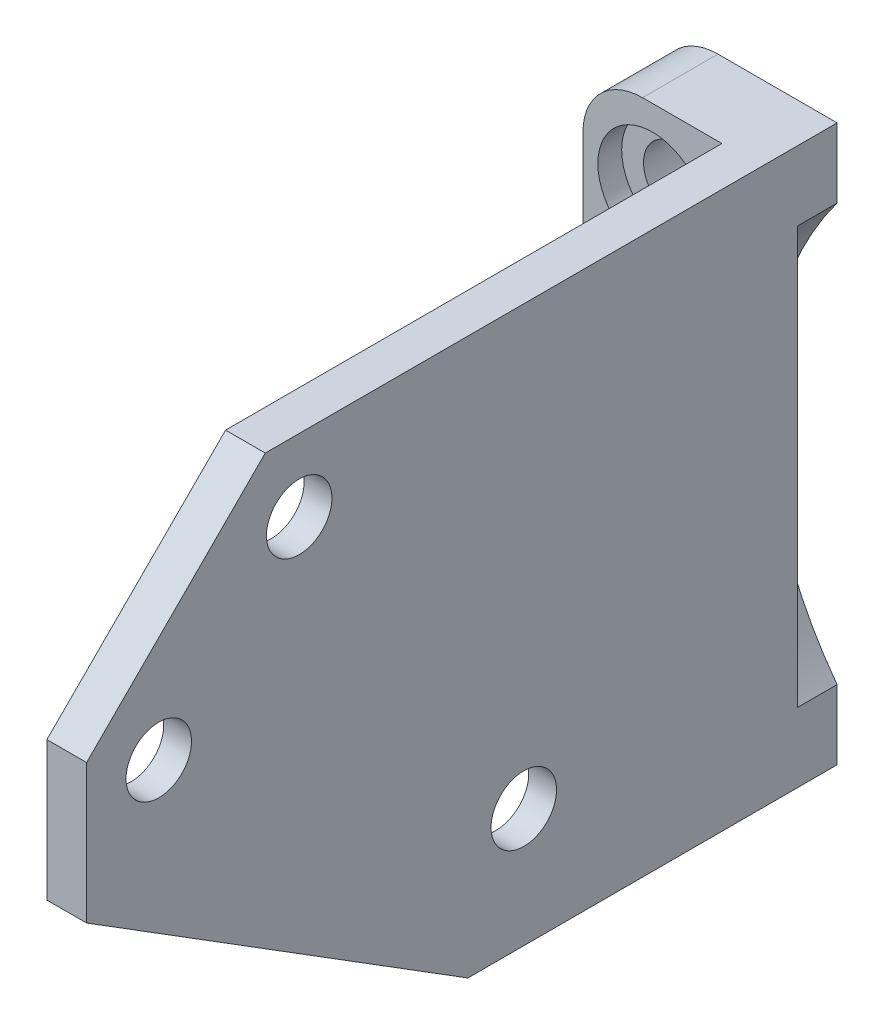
from build123d import *

# Parameters (mm, degrees)
SKETCH_1_W               = 9
SKETCH_1_H               = 28
EXTRUDE_1_DEPTH          = 34
CUT_EXTRUDE_START        = 3
SKETCH_2_W               = 7
SKETCH_2_H               = 28
CUT_EXTRUDE_1_DEPTH      = 41.370496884
SKETCH_3_R               = 1.65
CUT_EXTRUDE_2_DEPTH      = 38.429934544
SKETCH_4_R               = 2.75
CUT_EXTRUDE_3_DEPTH      = 0.6
CUT_EXTRUDE_4_DEPTH      = 38.429934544
SKETCH_6_R               = 1.65
CUT_EXTRUDE_5_DEPTH      = 42.060930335
SKETCH_7_R               = 2.75
CUT_EXTRUDE_6_DEPTH      = 1.2
CUT_EXTRUDE_7_DEPTH      = 38.429934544
CUT_EXTRUDE_7_DEPTH_BACK = 38.429934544
SKETCH_9_W               = 9
SKETCH_9_H               = 28
SKETCH_9_R               = 2.75
SKETCH_9_R_2             = 1.65
EXTRUDE_2_DEPTH          = 3.8
SKETCH_2_2_W             = 7
SKETCH_2_2_H             = 28
CUT_EXTRUDE_8_DEPTH      = 3.8
SKETCH_9_3_R             = 2.75
SKETCH_9_3_R_2           = 1.65
CUT_EXTRUDE_9_DEPTH      = 1.2
RIB_1_REACH              = 45.37
SKETCH_10_WALL_W         = 102.740993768
SKETCH_10_WALL_H         = 6
FILLET_1_R               = 3
FILLET_2_R               = 2.5
SKETCH_13_R              = 17.5
CUT_EXTRUDE_11_DEPTH     = 2


with BuildPart() as part:
    # Sketch 1 → Extrude 1 (new body)
    with BuildSketch(Plane.XY):
        with Locations((-18.5, 0)):
            Rectangle(SKETCH_1_W, SKETCH_1_H)
    extrude(amount=EXTRUDE_1_DEPTH)

    # Sketch 2 → Cut-Extrude 1 (cut, through all)
    with BuildSketch(Plane.XY.offset(CUT_EXTRUDE_START)):
        with Locations((-19.5, 0)):
            Rectangle(SKETCH_2_W, SKETCH_2_H)
    extrude(amount=CUT_EXTRUDE_1_DEPTH, mode=Mode.SUBTRACT)

    # Sketch 3 → Cut-Extrude 2 (cut, through all)
    with BuildSketch(Plane.ZY.offset(16)):
        with Locations((11.979898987, -8.020101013)):
            Circle(SKETCH_3_R)
        with Locations((23.293607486, 10.364675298)):
            Circle(SKETCH_3_R)
        with Locations((30.364675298, 3.293607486)):
            Circle(SKETCH_3_R)
    extrude(amount=-CUT_EXTRUDE_2_DEPTH, mode=Mode.SUBTRACT)

    # Sketch 4 → Cut-Extrude 3 (cut)
    with BuildSketch(Plane.ZY.offset(16)):
        with Locations((11.979898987, -8.020101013)):
            Circle(SKETCH_4_R)
        with Locations((23.293607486, 10.364675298)):
            Circle(SKETCH_4_R)
        with Locations((30.364675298, 3.293607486)):
            Circle(SKETCH_4_R)
    extrude(amount=-CUT_EXTRUDE_3_DEPTH, mode=Mode.SUBTRACT)

    # Sketch 5 → Cut-Extrude 4 (cut, through all)
    with BuildSketch(Plane.ZY.offset(16)):
        Polygon((34, 5), (25, 14), (34, 14), align=None)
    extrude(amount=-CUT_EXTRUDE_4_DEPTH, mode=Mode.SUBTRACT)

    # Sketch 6 → Cut-Extrude 5 (cut, through all)
    with BuildSketch(Plane.XY.offset(3)):
        with Locations((-19.5, 10)):
            Circle(SKETCH_6_R)
        with Locations((-19.5, -10)):
            Circle(SKETCH_6_R)
    extrude(amount=-CUT_EXTRUDE_5_DEPTH, mode=Mode.SUBTRACT)

    # Sketch 7 → Cut-Extrude 6 (cut)
    with BuildSketch(Plane.XY.offset(3)):
        with Locations((-19.5, 10)):
            Circle(SKETCH_7_R)
        with Locations((-19.5, -10)):
            Circle(SKETCH_7_R)
    extrude(amount=-CUT_EXTRUDE_6_DEPTH, mode=Mode.SUBTRACT)

    # Sketch 8 → Cut-Extrude 7 (cut, two sides: drawn at the far end of the back side and taken through both)
    with BuildSketch(Plane.ZY.offset(16).offset(-CUT_EXTRUDE_7_DEPTH_BACK)):
        Polygon((34, -2), (14.795985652, -14), (34, -14), align=None)
    extrude(amount=CUT_EXTRUDE_7_DEPTH + CUT_EXTRUDE_7_DEPTH_BACK, mode=Mode.SUBTRACT)

    # Sketch 9 → Extrude 2 (add)
    # profile 1 of 3: a face of its own
    with BuildSketch(Plane(origin=(0, 0, 0), x_dir=(-1, 0, 0), z_dir=(0, 0, -1))):
        with Locations((18.5, 0)):
            Rectangle(SKETCH_9_W, SKETCH_9_H)
        with Locations(Location((19.5, 10, 0), (0, 0, 180))):
            Circle(SKETCH_9_R, mode=Mode.SUBTRACT)
        with Locations(Location((19.5, -10, 0), (0, 0, 180))):
            Circle(SKETCH_9_R, mode=Mode.SUBTRACT)
    # profile 2 of 3: a face of its own
    with BuildSketch(Plane(origin=(0, 0, 0), x_dir=(-1, 0, 0), z_dir=(0, 0, -1))):
        with Locations(Location((19.5, 10, 0), (0, 0, 180))):
            Circle(SKETCH_9_R)
        with Locations(Location((19.5, 10, 0), (0, 0, 180))):
            Circle(SKETCH_9_R_2, mode=Mode.SUBTRACT)
    # profile 3 of 3: a face of its own
    with BuildSketch(Plane(origin=(0, 0, 0), x_dir=(-1, 0, 0), z_dir=(0, 0, -1))):
        with Locations(Location((19.5, -10, 0), (0, 0, 180))):
            Circle(SKETCH_9_R)
        with Locations(Location((19.5, -10, 0), (0, 0, 180))):
            Circle(SKETCH_9_R_2, mode=Mode.SUBTRACT)
    extrude(amount=EXTRUDE_2_DEPTH)

    # Sketch 2_2 → Cut-Extrude 8 (cut)
    with BuildSketch(Plane.XY):
        with Locations((-19.5, 0)):
            Rectangle(SKETCH_2_2_W, SKETCH_2_2_H)
    extrude(amount=CUT_EXTRUDE_8_DEPTH, mode=Mode.SUBTRACT)

    # Sketch 9_3 → Cut-Extrude 9 (cut)
    # profile 1 of 2: a face of its own
    with BuildSketch(Plane(origin=(0, 0, 0), x_dir=(-1, 0, 0), z_dir=(0, 0, -1))):
        with Locations((19.5, -10)):
            Circle(SKETCH_9_3_R)
        with Locations((19.5, -10)):
            Circle(SKETCH_9_3_R_2, mode=Mode.SUBTRACT)
    # profile 2 of 2: a face of its own
    with BuildSketch(Plane(origin=(0, 0, 0), x_dir=(-1, 0, 0), z_dir=(0, 0, -1))):
        with Locations((19.5, 10)):
            Circle(SKETCH_9_3_R)
    extrude(amount=CUT_EXTRUDE_9_DEPTH, mode=Mode.SUBTRACT)

    # Sketch 10 wall → Rib 1 (add, up to next)
    with BuildSketch(Plane(origin=(-19.5, 0, 6.062177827), x_dir=(-0.499999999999, 0, -0.866025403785), z_dir=(-0.866025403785, 0, 0.499999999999)), mode=Mode.PRIVATE) as rib_1_sk1:
        Rectangle(SKETCH_10_WALL_W, SKETCH_10_WALL_H)
    rib_1_tool1 = extrude(rib_1_sk1.sketch, amount=-RIB_1_REACH, mode=Mode.PRIVATE) - part.part
    add(rib_1_tool1.solids().sort_by_distance((-19.5, 0, 6.062177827))[0])

    # Fillet 1
    fillet_1_edges = [part.edges().sort_by_distance(p)[0] for p in [
        (-23, -14, -1.9),
        (-23, 14, -1.9),
    ]]
    fillet(fillet_1_edges, radius=FILLET_1_R)

    # Fillet 2
    fillet_2_edges = [part.edges().sort_by_distance(p)[0] for p in [
        (-19.5, -3, 0),
        (-19.5, 3, 0),
    ]]
    fillet(fillet_2_edges, radius=FILLET_2_R)

    # Sketch 13 → Cut-Extrude 11 (cut)
    with BuildSketch(Plane(origin=(0, 0, -3.8), x_dir=(-1, 0, 0), z_dir=(0, 0, -1))):
        Circle(SKETCH_13_R)
    extrude(amount=-CUT_EXTRUDE_11_DEPTH, mode=Mode.SUBTRACT)


solid = part.part
